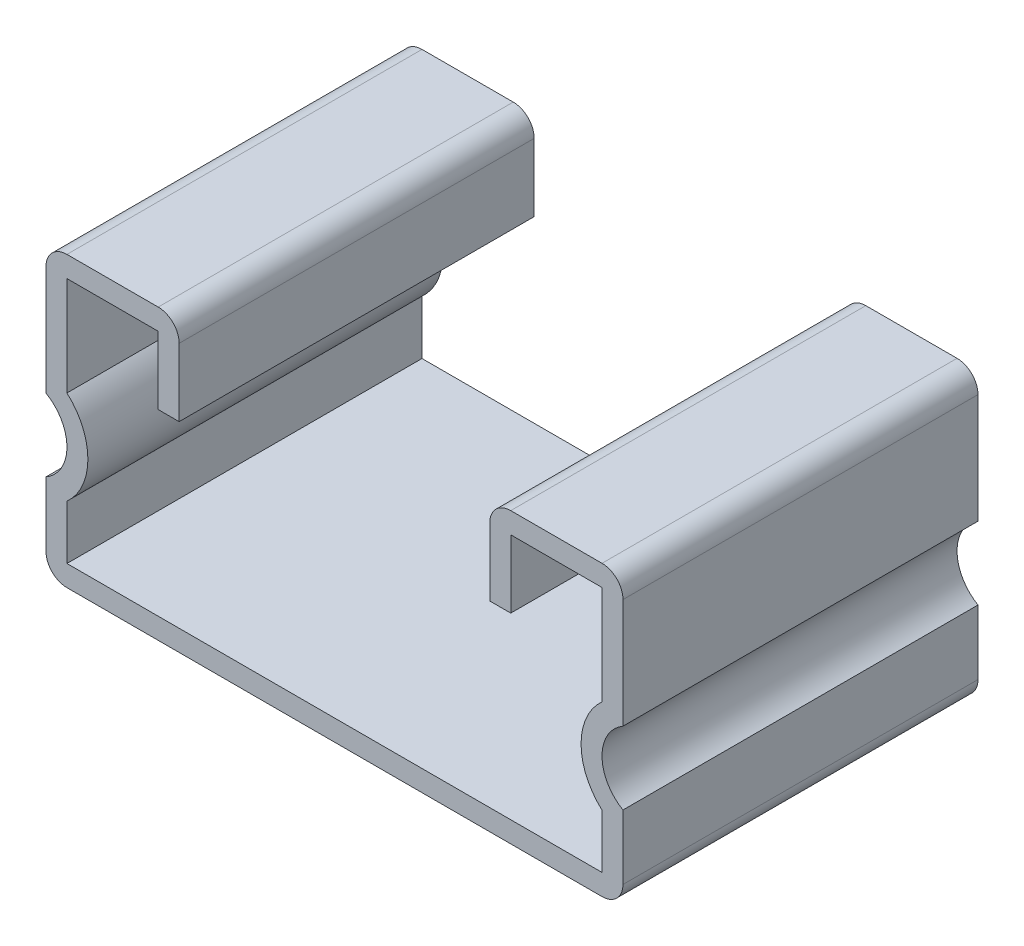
from build123d import *

# Parameters (mm, degrees)
BASE_EXTRUDE_DEPTH = 12.7


with BuildPart() as part:
    # Sketch1 → Base-Extrude (new, symmetric)
    with BuildSketch(Plane.XY):
        with BuildLine():
            Line((-20.6375, 10.4394), (-20.6375, 2.59565134))
            ThreePointArc((-20.6375, 2.59565134), (-19.1389, 0), (-20.6375, -2.59565134))
            Line((-20.6375, -2.59565134), (-20.6375, -7.2136))
            ThreePointArc((-20.6375, -7.2136), (-20.198570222, -8.273270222), (-19.1389, -8.7122))
            Line((-19.1389, -8.7122), (19.1389, -8.7122))
            ThreePointArc((19.1389, -8.7122), (20.198570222, -8.273270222), (20.6375, -7.2136))
            Line((20.6375, -7.2136), (20.6375, -2.59565134))
            ThreePointArc((20.6375, -2.59565134), (19.1389, 0), (20.6375, 2.59565134))
            Line((20.6375, 2.59565134), (20.6375, 10.4394))
            ThreePointArc((20.6375, 10.4394), (20.198570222, 11.499070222), (19.1389, 11.938))
            Line((19.1389, 11.938), (12.6111, 11.938))
            ThreePointArc((12.6111, 11.938), (11.551429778, 11.499070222), (11.1125, 10.4394))
            Line((11.1125, 10.4394), (11.1125, 5.588))
            Line((11.1125, 5.588), (12.6111, 5.588))
            Line((12.6111, 5.588), (12.6111, 10.4394))
            Line((12.6111, 10.4394), (19.1389, 10.4394))
            Line((19.1389, 10.4394), (19.1389, 3.350971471))
            ThreePointArc((19.1389, 3.350971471), (17.6403, 0), (19.1389, -3.350971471))
            Line((19.1389, -3.350971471), (19.1389, -7.2136))
            Line((19.1389, -7.2136), (-19.1389, -7.2136))
            Line((-19.1389, -7.2136), (-19.1389, -3.350971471))
            ThreePointArc((-19.1389, -3.350971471), (-17.6403, 0), (-19.1389, 3.350971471))
            Line((-19.1389, 3.350971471), (-19.1389, 10.4394))
            Line((-19.1389, 10.4394), (-12.6111, 10.4394))
            Line((-12.6111, 10.4394), (-12.6111, 5.588))
            Line((-12.6111, 5.588), (-11.1125, 5.588))
            Line((-11.1125, 5.588), (-11.1125, 10.4394))
            ThreePointArc((-11.1125, 10.4394), (-11.551429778, 11.499070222), (-12.6111, 11.938))
            Line((-12.6111, 11.938), (-19.1389, 11.938))
            ThreePointArc((-19.1389, 11.938), (-20.198570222, 11.499070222), (-20.6375, 10.4394))
        make_face()
    extrude(amount=BASE_EXTRUDE_DEPTH, both=True)


solid = part.part
